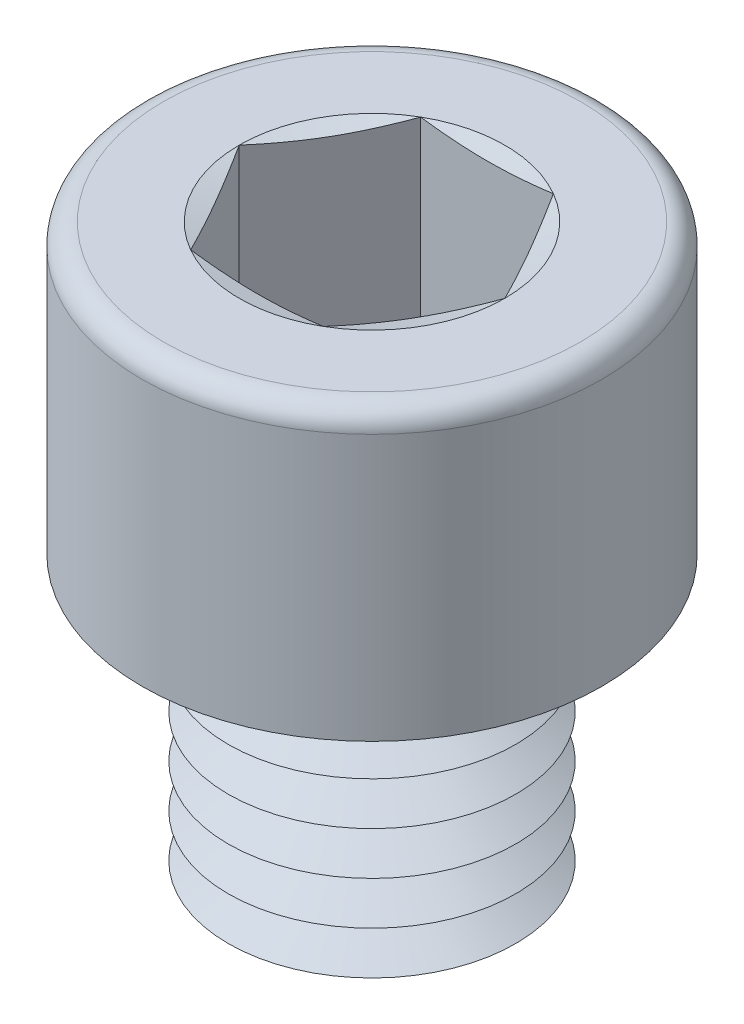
ISO-10303-21;
HEADER;
FILE_DESCRIPTION(('STEP AP214'),'2;1');
FILE_NAME('part.step','',(''),(''),'','','');
FILE_SCHEMA(('AUTOMOTIVE_DESIGN { 1 0 10303 214 1 1 1 1 }'));
ENDSEC;
DATA;
#1=APPLICATION_CONTEXT('core data for automotive mechanical design processes');
#2=APPLICATION_PROTOCOL_DEFINITION('international standard','automotive_design',2000,#1);
#3=PRODUCT_CONTEXT('',#1,'mechanical');
#4=PRODUCT('Part','Part','',(#3));
#5=PRODUCT_RELATED_PRODUCT_CATEGORY('part','',(#4));
#6=PRODUCT_DEFINITION_FORMATION('','',#4);
#7=PRODUCT_DEFINITION_CONTEXT('part definition',#1,'design');
#8=PRODUCT_DEFINITION('design','',#6,#7);
#9=PRODUCT_DEFINITION_SHAPE('','',#8);
#10=(LENGTH_UNIT() NAMED_UNIT(*) SI_UNIT(.MILLI.,.METRE.));
#11=(NAMED_UNIT(*) PLANE_ANGLE_UNIT() SI_UNIT($,.RADIAN.));
#12=(NAMED_UNIT(*) SI_UNIT($,.STERADIAN.) SOLID_ANGLE_UNIT());
#13=UNCERTAINTY_MEASURE_WITH_UNIT(LENGTH_MEASURE(1.E-05),#10,'distance_accuracy_value','');
#14=(GEOMETRIC_REPRESENTATION_CONTEXT(3) GLOBAL_UNCERTAINTY_ASSIGNED_CONTEXT((#13)) GLOBAL_UNIT_ASSIGNED_CONTEXT((#10,
#11,#12)) REPRESENTATION_CONTEXT('',''));
#15=CARTESIAN_POINT('',(0.,0.,0.));
#16=DIRECTION('',(0.,0.,1.));
#17=DIRECTION('',(1.,0.,0.));
#18=AXIS2_PLACEMENT_3D('',#15,#16,#17);
#19=CARTESIAN_POINT('',(0.,6.,0.));
#20=DIRECTION('',(0.,1.,0.));
#21=DIRECTION('',(0.,0.,1.));
#22=AXIS2_PLACEMENT_3D('',#19,#20,#21);
#23=CONICAL_SURFACE('',#22,3.70096189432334,1.0471975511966);
#24=CARTESIAN_POINT('',(0.,6.75,0.));
#25=DIRECTION('',(0.,1.,0.));
#26=DIRECTION('',(0.,0.,1.));
#27=AXIS2_PLACEMENT_3D('',#24,#25,#26);
#28=CIRCLE('',#27,5.);
#29=CARTESIAN_POINT('',(0.,6.75,5.));
#30=VERTEX_POINT('',#29);
#31=EDGE_CURVE('E368',#30,#30,#28,.T.);
#32=ORIENTED_EDGE('',*,*,#31,.F.);
#33=EDGE_LOOP('',(#32));
#34=FACE_BOUND('',#33,.T.);
#35=CARTESIAN_POINT('',(0.,6.,0.));
#36=DIRECTION('',(0.,1.,0.));
#37=DIRECTION('',(0.,0.,1.));
#38=AXIS2_PLACEMENT_3D('',#35,#36,#37);
#39=CIRCLE('',#38,3.70096189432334);
#40=CARTESIAN_POINT('',(0.,6.,3.70096189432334));
#41=VERTEX_POINT('',#40);
#42=EDGE_CURVE('E372',#41,#41,#39,.T.);
#43=ORIENTED_EDGE('',*,*,#42,.T.);
#44=EDGE_LOOP('',(#43));
#45=FACE_BOUND('',#44,.T.);
#46=ADVANCED_FACE('F41',(#34,#45),#23,.T.);
#47=CARTESIAN_POINT('',(0.,5.25,0.));
#48=DIRECTION('',(0.,-1.,0.));
#49=DIRECTION('',(0.,0.,-1.));
#50=AXIS2_PLACEMENT_3D('',#47,#48,#49);
#51=CONICAL_SURFACE('',#50,5.,1.0471975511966);
#52=ORIENTED_EDGE('',*,*,#42,.F.);
#53=EDGE_LOOP('',(#52));
#54=FACE_BOUND('',#53,.T.);
#55=CARTESIAN_POINT('',(0.,5.25,0.));
#56=DIRECTION('',(0.,1.,0.));
#57=DIRECTION('',(0.,0.,1.));
#58=AXIS2_PLACEMENT_3D('',#55,#56,#57);
#59=CIRCLE('',#58,5.);
#60=CARTESIAN_POINT('',(0.,5.25,5.));
#61=VERTEX_POINT('',#60);
#62=EDGE_CURVE('E375',#61,#61,#59,.T.);
#63=ORIENTED_EDGE('',*,*,#62,.T.);
#64=EDGE_LOOP('',(#63));
#65=FACE_BOUND('',#64,.T.);
#66=ADVANCED_FACE('F250',(#54,#65),#51,.T.);
#67=CARTESIAN_POINT('',(0.,0.,0.));
#68=DIRECTION('',(0.,1.,0.));
#69=DIRECTION('',(0.,0.,1.));
#70=AXIS2_PLACEMENT_3D('',#67,#68,#69);
#71=PLANE('',#70);
#72=CARTESIAN_POINT('',(0.,0.,0.));
#73=DIRECTION('',(0.,1.,0.));
#74=DIRECTION('',(0.,0.,1.));
#75=AXIS2_PLACEMENT_3D('',#72,#73,#74);
#76=CIRCLE('',#75,3.70096189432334);
#77=CARTESIAN_POINT('',(0.,0.,3.70096189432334));
#78=VERTEX_POINT('',#77);
#79=EDGE_CURVE('E402',#78,#78,#76,.T.);
#80=ORIENTED_EDGE('',*,*,#79,.F.);
#81=EDGE_LOOP('',(#80));
#82=FACE_BOUND('',#81,.T.);
#83=ADVANCED_FACE('F247',(#82),#71,.F.);
#84=CARTESIAN_POINT('',(0.,0.,0.));
#85=DIRECTION('',(0.,1.,0.));
#86=DIRECTION('',(0.,0.,1.));
#87=AXIS2_PLACEMENT_3D('',#84,#85,#86);
#88=CONICAL_SURFACE('',#87,3.70096189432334,1.0471975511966);
#89=CARTESIAN_POINT('',(0.,0.749999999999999,0.));
#90=DIRECTION('',(0.,1.,0.));
#91=DIRECTION('',(0.,0.,1.));
#92=AXIS2_PLACEMENT_3D('',#89,#90,#91);
#93=CIRCLE('',#92,5.);
#94=CARTESIAN_POINT('',(0.,0.749999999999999,5.));
#95=VERTEX_POINT('',#94);
#96=EDGE_CURVE('E399',#95,#95,#93,.T.);
#97=ORIENTED_EDGE('',*,*,#96,.F.);
#98=EDGE_LOOP('',(#97));
#99=FACE_BOUND('',#98,.T.);
#100=ORIENTED_EDGE('',*,*,#79,.T.);
#101=EDGE_LOOP('',(#100));
#102=FACE_BOUND('',#101,.T.);
#103=ADVANCED_FACE('F249',(#99,#102),#88,.T.);
#104=CARTESIAN_POINT('',(0.,0.749999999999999,0.));
#105=DIRECTION('',(0.,-1.,0.));
#106=DIRECTION('',(0.,0.,-1.));
#107=AXIS2_PLACEMENT_3D('',#104,#105,#106);
#108=CONICAL_SURFACE('',#107,5.,1.0471975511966);
#109=CARTESIAN_POINT('',(0.,1.5,0.));
#110=DIRECTION('',(0.,1.,0.));
#111=DIRECTION('',(0.,0.,1.));
#112=AXIS2_PLACEMENT_3D('',#109,#110,#111);
#113=CIRCLE('',#112,3.70096189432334);
#114=CARTESIAN_POINT('',(0.,1.5,3.70096189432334));
#115=VERTEX_POINT('',#114);
#116=EDGE_CURVE('E395',#115,#115,#113,.T.);
#117=ORIENTED_EDGE('',*,*,#116,.F.);
#118=EDGE_LOOP('',(#117));
#119=FACE_BOUND('',#118,.T.);
#120=ORIENTED_EDGE('',*,*,#96,.T.);
#121=EDGE_LOOP('',(#120));
#122=FACE_BOUND('',#121,.T.);
#123=ADVANCED_FACE('F290',(#119,#122),#108,.T.);
#124=CARTESIAN_POINT('',(0.,1.5,0.));
#125=DIRECTION('',(0.,1.,0.));
#126=DIRECTION('',(0.,0.,1.));
#127=AXIS2_PLACEMENT_3D('',#124,#125,#126);
#128=CONICAL_SURFACE('',#127,3.70096189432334,1.0471975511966);
#129=CARTESIAN_POINT('',(0.,2.25,0.));
#130=DIRECTION('',(0.,1.,0.));
#131=DIRECTION('',(0.,0.,1.));
#132=AXIS2_PLACEMENT_3D('',#129,#130,#131);
#133=CIRCLE('',#132,5.);
#134=CARTESIAN_POINT('',(0.,2.25,5.));
#135=VERTEX_POINT('',#134);
#136=EDGE_CURVE('E391',#135,#135,#133,.T.);
#137=ORIENTED_EDGE('',*,*,#136,.F.);
#138=EDGE_LOOP('',(#137));
#139=FACE_BOUND('',#138,.T.);
#140=ORIENTED_EDGE('',*,*,#116,.T.);
#141=EDGE_LOOP('',(#140));
#142=FACE_BOUND('',#141,.T.);
#143=ADVANCED_FACE('F285',(#139,#142),#128,.T.);
#144=CARTESIAN_POINT('',(0.,2.25,0.));
#145=DIRECTION('',(0.,-1.,0.));
#146=DIRECTION('',(0.,0.,-1.));
#147=AXIS2_PLACEMENT_3D('',#144,#145,#146);
#148=CONICAL_SURFACE('',#147,5.,1.0471975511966);
#149=CARTESIAN_POINT('',(0.,3.,0.));
#150=DIRECTION('',(0.,1.,0.));
#151=DIRECTION('',(0.,0.,1.));
#152=AXIS2_PLACEMENT_3D('',#149,#150,#151);
#153=CIRCLE('',#152,3.70096189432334);
#154=CARTESIAN_POINT('',(0.,3.,3.70096189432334));
#155=VERTEX_POINT('',#154);
#156=EDGE_CURVE('E387',#155,#155,#153,.T.);
#157=ORIENTED_EDGE('',*,*,#156,.F.);
#158=EDGE_LOOP('',(#157));
#159=FACE_BOUND('',#158,.T.);
#160=ORIENTED_EDGE('',*,*,#136,.T.);
#161=EDGE_LOOP('',(#160));
#162=FACE_BOUND('',#161,.T.);
#163=ADVANCED_FACE('F282',(#159,#162),#148,.T.);
#164=CARTESIAN_POINT('',(0.,3.,0.));
#165=DIRECTION('',(0.,1.,0.));
#166=DIRECTION('',(0.,0.,1.));
#167=AXIS2_PLACEMENT_3D('',#164,#165,#166);
#168=CONICAL_SURFACE('',#167,3.70096189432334,1.0471975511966);
#169=CARTESIAN_POINT('',(0.,3.75,0.));
#170=DIRECTION('',(0.,1.,0.));
#171=DIRECTION('',(0.,0.,1.));
#172=AXIS2_PLACEMENT_3D('',#169,#170,#171);
#173=CIRCLE('',#172,5.);
#174=CARTESIAN_POINT('',(0.,3.75,5.));
#175=VERTEX_POINT('',#174);
#176=EDGE_CURVE('E383',#175,#175,#173,.T.);
#177=ORIENTED_EDGE('',*,*,#176,.F.);
#178=EDGE_LOOP('',(#177));
#179=FACE_BOUND('',#178,.T.);
#180=ORIENTED_EDGE('',*,*,#156,.T.);
#181=EDGE_LOOP('',(#180));
#182=FACE_BOUND('',#181,.T.);
#183=ADVANCED_FACE('F276',(#179,#182),#168,.T.);
#184=CARTESIAN_POINT('',(0.,3.75,0.));
#185=DIRECTION('',(0.,-1.,0.));
#186=DIRECTION('',(0.,0.,-1.));
#187=AXIS2_PLACEMENT_3D('',#184,#185,#186);
#188=CONICAL_SURFACE('',#187,5.,1.0471975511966);
#189=CARTESIAN_POINT('',(0.,4.5,0.));
#190=DIRECTION('',(0.,1.,0.));
#191=DIRECTION('',(0.,0.,1.));
#192=AXIS2_PLACEMENT_3D('',#189,#190,#191);
#193=CIRCLE('',#192,3.70096189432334);
#194=CARTESIAN_POINT('',(0.,4.5,3.70096189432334));
#195=VERTEX_POINT('',#194);
#196=EDGE_CURVE('E379',#195,#195,#193,.T.);
#197=ORIENTED_EDGE('',*,*,#196,.F.);
#198=EDGE_LOOP('',(#197));
#199=FACE_BOUND('',#198,.T.);
#200=ORIENTED_EDGE('',*,*,#176,.T.);
#201=EDGE_LOOP('',(#200));
#202=FACE_BOUND('',#201,.T.);
#203=ADVANCED_FACE('F272',(#199,#202),#188,.T.);
#204=CARTESIAN_POINT('',(0.,4.5,0.));
#205=DIRECTION('',(0.,1.,0.));
#206=DIRECTION('',(0.,0.,1.));
#207=AXIS2_PLACEMENT_3D('',#204,#205,#206);
#208=CONICAL_SURFACE('',#207,3.70096189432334,1.0471975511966);
#209=ORIENTED_EDGE('',*,*,#62,.F.);
#210=EDGE_LOOP('',(#209));
#211=FACE_BOUND('',#210,.T.);
#212=ORIENTED_EDGE('',*,*,#196,.T.);
#213=EDGE_LOOP('',(#212));
#214=FACE_BOUND('',#213,.T.);
#215=ADVANCED_FACE('F275',(#211,#214),#208,.T.);
#216=CARTESIAN_POINT('',(0.,7.5,0.));
#217=DIRECTION('',(0.,1.,0.));
#218=DIRECTION('',(0.,0.,1.));
#219=AXIS2_PLACEMENT_3D('',#216,#217,#218);
#220=CONICAL_SURFACE('',#219,3.70096189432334,1.0471975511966);
#221=CARTESIAN_POINT('',(0.,8.25,0.));
#222=DIRECTION('',(0.,1.,0.));
#223=DIRECTION('',(0.,0.,1.));
#224=AXIS2_PLACEMENT_3D('',#221,#222,#223);
#225=CIRCLE('',#224,5.);
#226=CARTESIAN_POINT('',(0.,8.25,5.));
#227=VERTEX_POINT('',#226);
#228=EDGE_CURVE('E352',#227,#227,#225,.T.);
#229=ORIENTED_EDGE('',*,*,#228,.F.);
#230=EDGE_LOOP('',(#229));
#231=FACE_BOUND('',#230,.T.);
#232=CARTESIAN_POINT('',(0.,7.5,0.));
#233=DIRECTION('',(0.,1.,0.));
#234=DIRECTION('',(0.,0.,1.));
#235=AXIS2_PLACEMENT_3D('',#232,#233,#234);
#236=CIRCLE('',#235,3.70096189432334);
#237=CARTESIAN_POINT('',(0.,7.5,3.70096189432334));
#238=VERTEX_POINT('',#237);
#239=EDGE_CURVE('E364',#238,#238,#236,.T.);
#240=ORIENTED_EDGE('',*,*,#239,.T.);
#241=EDGE_LOOP('',(#240));
#242=FACE_BOUND('',#241,.T.);
#243=ADVANCED_FACE('F280',(#231,#242),#220,.T.);
#244=CARTESIAN_POINT('',(0.,6.75,0.));
#245=DIRECTION('',(0.,-1.,0.));
#246=DIRECTION('',(0.,0.,-1.));
#247=AXIS2_PLACEMENT_3D('',#244,#245,#246);
#248=CONICAL_SURFACE('',#247,5.,1.0471975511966);
#249=ORIENTED_EDGE('',*,*,#239,.F.);
#250=EDGE_LOOP('',(#249));
#251=FACE_BOUND('',#250,.T.);
#252=ORIENTED_EDGE('',*,*,#31,.T.);
#253=EDGE_LOOP('',(#252));
#254=FACE_BOUND('',#253,.T.);
#255=ADVANCED_FACE('F641',(#251,#254),#248,.T.);
#256=CARTESIAN_POINT('',(0.,9.,0.));
#257=DIRECTION('',(0.,1.,0.));
#258=DIRECTION('',(0.,0.,1.));
#259=AXIS2_PLACEMENT_3D('',#256,#257,#258);
#260=CONICAL_SURFACE('',#259,3.70096189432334,1.0471975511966);
#261=CARTESIAN_POINT('',(0.,9.75,0.));
#262=DIRECTION('',(0.,1.,0.));
#263=DIRECTION('',(0.,0.,1.));
#264=AXIS2_PLACEMENT_3D('',#261,#262,#263);
#265=CIRCLE('',#264,5.);
#266=CARTESIAN_POINT('',(0.,9.75,5.));
#267=VERTEX_POINT('',#266);
#268=EDGE_CURVE('E359',#267,#267,#265,.T.);
#269=ORIENTED_EDGE('',*,*,#268,.F.);
#270=EDGE_LOOP('',(#269));
#271=FACE_BOUND('',#270,.T.);
#272=CARTESIAN_POINT('',(0.,9.,0.));
#273=DIRECTION('',(0.,1.,0.));
#274=DIRECTION('',(0.,0.,1.));
#275=AXIS2_PLACEMENT_3D('',#272,#273,#274);
#276=CIRCLE('',#275,3.70096189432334);
#277=CARTESIAN_POINT('',(0.,9.,3.70096189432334));
#278=VERTEX_POINT('',#277);
#279=EDGE_CURVE('E347',#278,#278,#276,.T.);
#280=ORIENTED_EDGE('',*,*,#279,.T.);
#281=EDGE_LOOP('',(#280));
#282=FACE_BOUND('',#281,.T.);
#283=ADVANCED_FACE('F650',(#271,#282),#260,.T.);
#284=CARTESIAN_POINT('',(0.,8.25,0.));
#285=DIRECTION('',(0.,-1.,0.));
#286=DIRECTION('',(0.,0.,-1.));
#287=AXIS2_PLACEMENT_3D('',#284,#285,#286);
#288=CONICAL_SURFACE('',#287,5.,1.0471975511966);
#289=ORIENTED_EDGE('',*,*,#279,.F.);
#290=EDGE_LOOP('',(#289));
#291=FACE_BOUND('',#290,.T.);
#292=ORIENTED_EDGE('',*,*,#228,.T.);
#293=EDGE_LOOP('',(#292));
#294=FACE_BOUND('',#293,.T.);
#295=ADVANCED_FACE('F194',(#291,#294),#288,.T.);
#296=CARTESIAN_POINT('',(0.,20.,0.));
#297=DIRECTION('',(0.,1.,0.));
#298=DIRECTION('',(0.,0.,1.));
#299=AXIS2_PLACEMENT_3D('',#296,#297,#298);
#300=PLANE('',#299);
#301=CARTESIAN_POINT('',(0.,20.,0.));
#302=DIRECTION('',(0.,1.,0.));
#303=DIRECTION('',(0.,0.,1.));
#304=AXIS2_PLACEMENT_3D('',#301,#302,#303);
#305=CIRCLE('',#304,4.61880215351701);
#306=CARTESIAN_POINT('',(2.3094010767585,20.,4.));
#307=VERTEX_POINT('',#306);
#308=CARTESIAN_POINT('',(4.61880215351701,20.,0.));
#309=VERTEX_POINT('',#308);
#310=EDGE_CURVE('E121',#307,#309,#305,.T.);
#311=ORIENTED_EDGE('',*,*,#310,.F.);
#312=CARTESIAN_POINT('',(0.,20.,0.));
#313=DIRECTION('',(0.,1.,0.));
#314=DIRECTION('',(0.,0.,1.));
#315=AXIS2_PLACEMENT_3D('',#312,#313,#314);
#316=CIRCLE('',#315,4.61880215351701);
#317=CARTESIAN_POINT('',(-2.3094010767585,20.,4.));
#318=VERTEX_POINT('',#317);
#319=EDGE_CURVE('E45',#318,#307,#316,.T.);
#320=ORIENTED_EDGE('',*,*,#319,.F.);
#321=CARTESIAN_POINT('',(-4.61880215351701,20.,0.));
#322=VERTEX_POINT('',#321);
#323=EDGE_CURVE('E138',#322,#318,#316,.T.);
#324=ORIENTED_EDGE('',*,*,#323,.F.);
#325=CARTESIAN_POINT('',(-2.3094010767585,20.,-4.));
#326=VERTEX_POINT('',#325);
#327=EDGE_CURVE('E476',#326,#322,#316,.T.);
#328=ORIENTED_EDGE('',*,*,#327,.F.);
#329=CARTESIAN_POINT('',(2.3094010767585,20.,-4.));
#330=VERTEX_POINT('',#329);
#331=EDGE_CURVE('E51',#330,#326,#316,.T.);
#332=ORIENTED_EDGE('',*,*,#331,.F.);
#333=EDGE_CURVE('E11',#309,#330,#316,.T.);
#334=ORIENTED_EDGE('',*,*,#333,.F.);
#335=EDGE_LOOP('',(#311,#320,#324,#328,#332,#334));
#336=FACE_BOUND('',#335,.T.);
#337=CARTESIAN_POINT('',(0.,20.,0.));
#338=DIRECTION('',(0.,1.,0.));
#339=DIRECTION('',(0.,0.,1.));
#340=AXIS2_PLACEMENT_3D('',#337,#338,#339);
#341=CIRCLE('',#340,7.25);
#342=CARTESIAN_POINT('',(0.,20.,7.25));
#343=VERTEX_POINT('',#342);
#344=EDGE_CURVE('E446',#343,#343,#341,.T.);
#345=ORIENTED_EDGE('',*,*,#344,.T.);
#346=EDGE_LOOP('',(#345));
#347=FACE_BOUND('',#346,.T.);
#348=ADVANCED_FACE('F140',(#336,#347),#300,.T.);
#349=CARTESIAN_POINT('',(0.,19.25,0.));
#350=DIRECTION('',(0.,1.,0.));
#351=DIRECTION('',(0.,0.,1.));
#352=AXIS2_PLACEMENT_3D('',#349,#350,#351);
#353=TOROIDAL_SURFACE('',#352,7.25,0.75);
#354=CARTESIAN_POINT('',(0.,19.25,0.));
#355=DIRECTION('',(0.,1.,0.));
#356=DIRECTION('',(0.,0.,1.));
#357=AXIS2_PLACEMENT_3D('',#354,#355,#356);
#358=CIRCLE('',#357,8.);
#359=CARTESIAN_POINT('',(0.,19.25,8.));
#360=VERTEX_POINT('',#359);
#361=EDGE_CURVE('E449',#360,#360,#358,.F.);
#362=ORIENTED_EDGE('',*,*,#361,.F.);
#363=EDGE_LOOP('',(#362));
#364=FACE_BOUND('',#363,.T.);
#365=ORIENTED_EDGE('',*,*,#344,.F.);
#366=EDGE_LOOP('',(#365));
#367=FACE_BOUND('',#366,.T.);
#368=ADVANCED_FACE('F43',(#364,#367),#353,.T.);
#369=CARTESIAN_POINT('',(0.,20.,0.));
#370=DIRECTION('',(0.,-1.,0.));
#371=DIRECTION('',(0.,0.,-1.));
#372=AXIS2_PLACEMENT_3D('',#369,#370,#371);
#373=CYLINDRICAL_SURFACE('',#372,8.);
#374=ORIENTED_EDGE('',*,*,#361,.T.);
#375=EDGE_LOOP('',(#374));
#376=FACE_BOUND('',#375,.T.);
#377=CARTESIAN_POINT('',(0.,10.,0.));
#378=DIRECTION('',(0.,1.,0.));
#379=DIRECTION('',(0.,0.,1.));
#380=AXIS2_PLACEMENT_3D('',#377,#378,#379);
#381=CIRCLE('',#380,8.);
#382=CARTESIAN_POINT('',(0.,10.,8.));
#383=VERTEX_POINT('',#382);
#384=EDGE_CURVE('E433',#383,#383,#381,.T.);
#385=ORIENTED_EDGE('',*,*,#384,.T.);
#386=EDGE_LOOP('',(#385));
#387=FACE_BOUND('',#386,.T.);
#388=ADVANCED_FACE('F242',(#376,#387),#373,.T.);
#389=CARTESIAN_POINT('',(0.,10.,0.));
#390=DIRECTION('',(0.,1.,0.));
#391=DIRECTION('',(0.,0.,1.));
#392=AXIS2_PLACEMENT_3D('',#389,#390,#391);
#393=PLANE('',#392);
#394=ORIENTED_EDGE('',*,*,#384,.F.);
#395=EDGE_LOOP('',(#394));
#396=FACE_BOUND('',#395,.T.);
#397=CARTESIAN_POINT('',(0.,10.,0.));
#398=DIRECTION('',(0.,1.,0.));
#399=DIRECTION('',(0.,0.,1.));
#400=AXIS2_PLACEMENT_3D('',#397,#398,#399);
#401=CIRCLE('',#400,5.);
#402=CARTESIAN_POINT('',(0.,10.,5.));
#403=VERTEX_POINT('',#402);
#404=EDGE_CURVE('E442',#403,#403,#401,.T.);
#405=ORIENTED_EDGE('',*,*,#404,.T.);
#406=EDGE_LOOP('',(#405));
#407=FACE_BOUND('',#406,.T.);
#408=ADVANCED_FACE('F238',(#396,#407),#393,.F.);
#409=CARTESIAN_POINT('',(0.,10.,0.));
#410=DIRECTION('',(0.,-1.,0.));
#411=DIRECTION('',(0.,0.,-1.));
#412=AXIS2_PLACEMENT_3D('',#409,#410,#411);
#413=CYLINDRICAL_SURFACE('',#412,5.);
#414=ORIENTED_EDGE('',*,*,#268,.T.);
#415=EDGE_LOOP('',(#414));
#416=FACE_BOUND('',#415,.T.);
#417=ORIENTED_EDGE('',*,*,#404,.F.);
#418=EDGE_LOOP('',(#417));
#419=FACE_BOUND('',#418,.T.);
#420=ADVANCED_FACE('F241',(#416,#419),#413,.T.);
#421=CARTESIAN_POINT('',(0.,20.,0.));
#422=DIRECTION('',(0.,1.,0.));
#423=DIRECTION('',(0.,0.,1.));
#424=AXIS2_PLACEMENT_3D('',#421,#422,#423);
#425=CONICAL_SURFACE('',#424,4.61880215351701,1.30899693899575);
#426=ORIENTED_EDGE('',*,*,#319,.T.);
#427=CARTESIAN_POINT('',(-6.02881516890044,20.7010337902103,4.));
#428=CARTESIAN_POINT('',(-5.8481958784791,20.6607170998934,4.));
#429=CARTESIAN_POINT('',(-5.66746141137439,20.6209072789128,4.));
#430=CARTESIAN_POINT('',(-5.30570552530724,20.5425748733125,4.));
#431=CARTESIAN_POINT('',(-5.12468409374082,20.5040523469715,4.));
#432=CARTESIAN_POINT('',(-4.76212658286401,20.4285326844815,4.));
#433=CARTESIAN_POINT('',(-4.58059016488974,20.3915371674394,4.));
#434=CARTESIAN_POINT('',(-4.21713405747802,20.3194839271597,4.));
#435=CARTESIAN_POINT('',(-4.03521437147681,20.2844261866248,4.));
#436=CARTESIAN_POINT('',(-3.67250657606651,20.217001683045,4.));
#437=CARTESIAN_POINT('',(-3.49172236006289,20.1846141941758,4.));
#438=CARTESIAN_POINT('',(-3.12965653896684,20.1227577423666,4.));
#439=CARTESIAN_POINT('',(-2.94837492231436,20.093288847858,4.));
#440=CARTESIAN_POINT('',(-2.40374454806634,20.0102645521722,4.));
#441=CARTESIAN_POINT('',(-2.03952090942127,19.9620742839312,4.));
#442=CARTESIAN_POINT('',(-1.48950033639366,19.905182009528,4.));
#443=CARTESIAN_POINT('',(-1.30450135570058,19.8887355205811,4.));
#444=CARTESIAN_POINT('',(-0.934053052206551,19.861988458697,4.));
#445=CARTESIAN_POINT('',(-0.74860373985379,19.8516877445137,4.));
#446=CARTESIAN_POINT('',(-0.377528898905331,19.8378309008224,4.));
#447=CARTESIAN_POINT('',(-0.191903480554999,19.834271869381,4.));
#448=CARTESIAN_POINT('',(0.179350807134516,19.8341156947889,4.));
#449=CARTESIAN_POINT('',(0.364979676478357,19.8375185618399,4.));
#450=CARTESIAN_POINT('',(0.736742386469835,19.8510980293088,4.));
#451=CARTESIAN_POINT('',(0.922875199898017,19.8613021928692,4.));
#452=CARTESIAN_POINT('',(1.29469888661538,19.8879135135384,4.));
#453=CARTESIAN_POINT('',(1.48038973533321,19.9043210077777,4.));
#454=CARTESIAN_POINT('',(1.85132520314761,19.942529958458,4.));
#455=CARTESIAN_POINT('',(2.036569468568,19.9643347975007,4.));
#456=CARTESIAN_POINT('',(2.40646407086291,20.0124559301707,4.));
#457=CARTESIAN_POINT('',(2.59111440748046,20.0387722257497,4.));
#458=CARTESIAN_POINT('',(2.96467049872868,20.0958323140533,4.));
#459=CARTESIAN_POINT('',(3.15356118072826,20.1266739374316,4.));
#460=CARTESIAN_POINT('',(3.53080577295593,20.1914895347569,4.));
#461=CARTESIAN_POINT('',(3.71915966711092,20.225463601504,4.));
#462=CARTESIAN_POINT('',(4.2835627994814,20.331122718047,4.));
#463=CARTESIAN_POINT('',(4.65891157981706,20.4065379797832,4.));
#464=CARTESIAN_POINT('',(5.40835351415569,20.5637698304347,4.));
#465=CARTESIAN_POINT('',(5.78244627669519,20.6455882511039,4.));
#466=CARTESIAN_POINT('',(6.52968076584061,20.8134827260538,4.));
#467=CARTESIAN_POINT('',(6.90282246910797,20.8995588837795,4.));
#468=CARTESIAN_POINT('',(7.64386653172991,21.0735615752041,4.));
#469=CARTESIAN_POINT('',(8.01177724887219,21.1614526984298,4.));
#470=CARTESIAN_POINT('',(8.74711499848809,21.3392675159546,4.));
#471=CARTESIAN_POINT('',(9.11454201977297,21.4291912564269,4.));
#472=CARTESIAN_POINT('',(9.84851788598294,21.6103931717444,4.));
#473=CARTESIAN_POINT('',(10.2150672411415,21.7016692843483,4.));
#474=CARTESIAN_POINT('',(10.9478692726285,21.8853497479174,4.));
#475=CARTESIAN_POINT('',(11.3141219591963,21.977754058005,4.));
#476=CARTESIAN_POINT('',(11.6802738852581,22.0705515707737,4.));
#477=B_SPLINE_CURVE_WITH_KNOTS('',3,(#427,#428,#429,#430,#431,#432,#433,#434,#435,#436,#437,
#438,#439,#440,#441,#442,#443,#444,#445,#446,#447,#448,#449,#450,#451,#452,#453,#454,#455,#456,
#457,#458,#459,#460,#461,#462,#463,#464,#465,#466,#467,#468,#469,#470,#471,#472,#473,#474,#475,
#476),.UNSPECIFIED.,.F.,.F.,(4,2,2,2,2,2,2,2,2,2,2,2,2,2,2,2,2,2,2,2,2,2,2,2,4),(0.,
0.555194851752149,1.11041480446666,1.6662090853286,2.22199840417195,2.77296094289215,
3.32393639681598,4.42561440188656,4.98271716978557,5.5398071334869,6.09665724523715,
6.65350817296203,7.21262964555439,7.77178150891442,8.33128469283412,8.89078811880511,
9.46493123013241,10.0390913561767,11.1875388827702,12.3363161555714,13.4851213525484,
14.6199040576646,15.7547125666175,16.8879395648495,18.0211256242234),.UNSPECIFIED.);
#478=EDGE_CURVE('E127',#318,#307,#477,.T.);
#479=ORIENTED_EDGE('',*,*,#478,.F.);
#480=EDGE_LOOP('',(#426,#479));
#481=FACE_BOUND('',#480,.T.);
#482=ADVANCED_FACE('F132',(#481),#425,.F.);
#483=ORIENTED_EDGE('',*,*,#323,.T.);
#484=CARTESIAN_POINT('',(-4.61891762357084,20.0000309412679,-0.000200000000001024));
#485=CARTESIAN_POINT('',(-4.52300443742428,19.9743194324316,0.165926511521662));
#486=CARTESIAN_POINT('',(-4.42691734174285,19.9509775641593,0.332354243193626));
#487=CARTESIAN_POINT('',(-4.23440378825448,19.9099680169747,0.665797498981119));
#488=CARTESIAN_POINT('',(-4.13797720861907,19.8923026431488,0.832813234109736));
#489=CARTESIAN_POINT('',(-3.94536936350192,19.8636774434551,1.16641980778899));
#490=CARTESIAN_POINT('',(-3.84918940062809,19.8526834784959,1.33300839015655));
#491=CARTESIAN_POINT('',(-3.65670681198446,19.8379416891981,1.66639801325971));
#492=CARTESIAN_POINT('',(-3.56040421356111,19.8341924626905,1.83319900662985));
#493=CARTESIAN_POINT('',(-3.3677990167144,19.8341924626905,2.16680099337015));
#494=CARTESIAN_POINT('',(-3.27149641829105,19.8379416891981,2.33360198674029));
#495=CARTESIAN_POINT('',(-3.07901382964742,19.8526834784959,2.66699160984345));
#496=CARTESIAN_POINT('',(-2.98283386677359,19.8636774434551,2.83358019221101));
#497=CARTESIAN_POINT('',(-2.79022602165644,19.8923026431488,3.16718676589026));
#498=CARTESIAN_POINT('',(-2.69379944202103,19.9099680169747,3.33420250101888));
#499=CARTESIAN_POINT('',(-2.50128588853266,19.9509775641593,3.66764575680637));
#500=CARTESIAN_POINT('',(-2.40519879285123,19.9743194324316,3.83407348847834));
#501=CARTESIAN_POINT('',(-2.30928560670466,20.0000309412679,4.0002));
#502=B_SPLINE_CURVE_WITH_KNOTS('',3,(#484,#485,#486,#487,#488,#489,#490,#491,#492,#493,#494,
#495,#496,#497,#498,#499,#500,#501),.UNSPECIFIED.,.F.,.F.,(4,2,2,2,2,2,2,2,4),(0.,
0.580655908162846,1.1615473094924,1.73944052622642,2.31722188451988,2.89500324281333,
3.47289645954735,4.05378786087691,4.63444376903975),.UNSPECIFIED.);
#503=EDGE_CURVE('E163',#322,#318,#502,.T.);
#504=ORIENTED_EDGE('',*,*,#503,.F.);
#505=EDGE_LOOP('',(#483,#504));
#506=FACE_BOUND('',#505,.T.);
#507=ADVANCED_FACE('F257',(#506),#425,.F.);
#508=ORIENTED_EDGE('',*,*,#327,.T.);
#509=CARTESIAN_POINT('',(-2.30928560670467,20.0000309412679,-4.0002));
#510=CARTESIAN_POINT('',(-2.40519879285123,19.9743194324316,-3.83407348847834));
#511=CARTESIAN_POINT('',(-2.50128588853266,19.9509775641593,-3.66764575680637));
#512=CARTESIAN_POINT('',(-2.69379944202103,19.9099680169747,-3.33420250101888));
#513=CARTESIAN_POINT('',(-2.79022602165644,19.8923026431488,-3.16718676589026));
#514=CARTESIAN_POINT('',(-2.98283386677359,19.8636774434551,-2.83358019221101));
#515=CARTESIAN_POINT('',(-3.07901382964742,19.8526834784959,-2.66699160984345));
#516=CARTESIAN_POINT('',(-3.27149641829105,19.8379416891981,-2.33360198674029));
#517=CARTESIAN_POINT('',(-3.3677990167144,19.8341924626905,-2.16680099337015));
#518=CARTESIAN_POINT('',(-3.56040421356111,19.8341924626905,-1.83319900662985));
#519=CARTESIAN_POINT('',(-3.65670681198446,19.8379416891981,-1.66639801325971));
#520=CARTESIAN_POINT('',(-3.84918940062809,19.8526834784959,-1.33300839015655));
#521=CARTESIAN_POINT('',(-3.94536936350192,19.8636774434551,-1.16641980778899));
#522=CARTESIAN_POINT('',(-4.13797720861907,19.8923026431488,-0.832813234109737));
#523=CARTESIAN_POINT('',(-4.23440378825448,19.9099680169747,-0.665797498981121));
#524=CARTESIAN_POINT('',(-4.42691734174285,19.9509775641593,-0.332354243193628));
#525=CARTESIAN_POINT('',(-4.52300443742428,19.9743194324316,-0.165926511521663));
#526=CARTESIAN_POINT('',(-4.61891762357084,20.0000309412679,0.000199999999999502));
#527=B_SPLINE_CURVE_WITH_KNOTS('',3,(#509,#510,#511,#512,#513,#514,#515,#516,#517,#518,#519,
#520,#521,#522,#523,#524,#525,#526),.UNSPECIFIED.,.F.,.F.,(4,2,2,2,2,2,2,2,4),(0.,
0.580655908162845,1.1615473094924,1.73944052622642,2.31722188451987,2.89500324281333,
3.47289645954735,4.0537878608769,4.63444376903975),.UNSPECIFIED.);
#528=EDGE_CURVE('E63',#326,#322,#527,.T.);
#529=ORIENTED_EDGE('',*,*,#528,.F.);
#530=EDGE_LOOP('',(#508,#529));
#531=FACE_BOUND('',#530,.T.);
#532=ADVANCED_FACE('F192',(#531),#425,.F.);
#533=ORIENTED_EDGE('',*,*,#331,.T.);
#534=CARTESIAN_POINT('',(-6.02881516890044,20.7010337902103,-4.));
#535=CARTESIAN_POINT('',(-5.8481958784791,20.6607170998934,-4.));
#536=CARTESIAN_POINT('',(-5.66746141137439,20.6209072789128,-4.));
#537=CARTESIAN_POINT('',(-5.30570552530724,20.5425748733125,-4.));
#538=CARTESIAN_POINT('',(-5.12468409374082,20.5040523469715,-4.));
#539=CARTESIAN_POINT('',(-4.76212658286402,20.4285326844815,-4.));
#540=CARTESIAN_POINT('',(-4.58059016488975,20.3915371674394,-4.));
#541=CARTESIAN_POINT('',(-4.21713405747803,20.3194839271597,-4.));
#542=CARTESIAN_POINT('',(-4.03521437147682,20.2844261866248,-4.));
#543=CARTESIAN_POINT('',(-3.67250657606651,20.217001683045,-4.));
#544=CARTESIAN_POINT('',(-3.49172236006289,20.1846141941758,-4.));
#545=CARTESIAN_POINT('',(-3.12965653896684,20.1227577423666,-4.));
#546=CARTESIAN_POINT('',(-2.94837492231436,20.093288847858,-4.));
#547=CARTESIAN_POINT('',(-2.40374454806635,20.0102645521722,-4.));
#548=CARTESIAN_POINT('',(-2.03952090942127,19.9620742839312,-4.));
#549=CARTESIAN_POINT('',(-1.48950033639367,19.905182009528,-4.));
#550=CARTESIAN_POINT('',(-1.30450135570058,19.8887355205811,-4.));
#551=CARTESIAN_POINT('',(-0.934053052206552,19.861988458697,-4.));
#552=CARTESIAN_POINT('',(-0.748603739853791,19.8516877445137,-4.));
#553=CARTESIAN_POINT('',(-0.377528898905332,19.8378309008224,-4.));
#554=CARTESIAN_POINT('',(-0.191903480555,19.834271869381,-4.));
#555=CARTESIAN_POINT('',(0.179350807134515,19.8341156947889,-4.));
#556=CARTESIAN_POINT('',(0.364979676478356,19.8375185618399,-4.));
#557=CARTESIAN_POINT('',(0.736742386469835,19.8510980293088,-4.));
#558=CARTESIAN_POINT('',(0.922875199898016,19.8613021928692,-4.));
#559=CARTESIAN_POINT('',(1.29469888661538,19.8879135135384,-4.));
#560=CARTESIAN_POINT('',(1.48038973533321,19.9043210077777,-4.));
#561=CARTESIAN_POINT('',(1.85132520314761,19.942529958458,-4.));
#562=CARTESIAN_POINT('',(2.036569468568,19.9643347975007,-4.));
#563=CARTESIAN_POINT('',(2.40646407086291,20.0124559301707,-4.));
#564=CARTESIAN_POINT('',(2.59111440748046,20.0387722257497,-4.));
#565=CARTESIAN_POINT('',(2.96467049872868,20.0958323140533,-4.));
#566=CARTESIAN_POINT('',(3.15356118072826,20.1266739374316,-4.));
#567=CARTESIAN_POINT('',(3.53080577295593,20.1914895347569,-4.));
#568=CARTESIAN_POINT('',(3.71915966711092,20.225463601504,-4.));
#569=CARTESIAN_POINT('',(4.2835627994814,20.331122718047,-4.));
#570=CARTESIAN_POINT('',(4.65891157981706,20.4065379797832,-4.));
#571=CARTESIAN_POINT('',(5.40835351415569,20.5637698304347,-4.));
#572=CARTESIAN_POINT('',(5.78244627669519,20.6455882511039,-4.));
#573=CARTESIAN_POINT('',(6.52968076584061,20.8134827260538,-4.));
#574=CARTESIAN_POINT('',(6.90282246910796,20.8995588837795,-4.));
#575=CARTESIAN_POINT('',(7.64386653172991,21.0735615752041,-4.));
#576=CARTESIAN_POINT('',(8.01177724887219,21.1614526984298,-4.));
#577=CARTESIAN_POINT('',(8.74711499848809,21.3392675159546,-4.));
#578=CARTESIAN_POINT('',(9.11454201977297,21.4291912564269,-4.));
#579=CARTESIAN_POINT('',(9.84851788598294,21.6103931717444,-4.));
#580=CARTESIAN_POINT('',(10.2150672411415,21.7016692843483,-4.));
#581=CARTESIAN_POINT('',(10.9478692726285,21.8853497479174,-4.));
#582=CARTESIAN_POINT('',(11.3141219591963,21.977754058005,-4.));
#583=CARTESIAN_POINT('',(11.6802738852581,22.0705515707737,-4.));
#584=B_SPLINE_CURVE_WITH_KNOTS('',3,(#534,#535,#536,#537,#538,#539,#540,#541,#542,#543,#544,
#545,#546,#547,#548,#549,#550,#551,#552,#553,#554,#555,#556,#557,#558,#559,#560,#561,#562,#563,
#564,#565,#566,#567,#568,#569,#570,#571,#572,#573,#574,#575,#576,#577,#578,#579,#580,#581,#582,
#583),.UNSPECIFIED.,.F.,.F.,(4,2,2,2,2,2,2,2,2,2,2,2,2,2,2,2,2,2,2,2,2,2,2,2,4),(0.,
0.555194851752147,1.11041480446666,1.66620908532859,2.22199840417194,2.77296094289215,
3.32393639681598,4.42561440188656,4.98271716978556,5.53980713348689,6.09665724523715,
6.65350817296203,7.21262964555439,7.77178150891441,8.33128469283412,8.89078811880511,
9.46493123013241,10.0390913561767,11.1875388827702,12.3363161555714,13.4851213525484,
14.6199040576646,15.7547125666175,16.8879395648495,18.0211256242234),.UNSPECIFIED.);
#585=EDGE_CURVE('E213',#330,#326,#584,.F.);
#586=ORIENTED_EDGE('',*,*,#585,.F.);
#587=EDGE_LOOP('',(#533,#586));
#588=FACE_BOUND('',#587,.T.);
#589=ADVANCED_FACE('F187',(#588),#425,.F.);
#590=ORIENTED_EDGE('',*,*,#333,.T.);
#591=CARTESIAN_POINT('',(4.61891762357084,20.0000309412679,0.000200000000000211));
#592=CARTESIAN_POINT('',(4.52300443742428,19.9743194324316,-0.165926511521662));
#593=CARTESIAN_POINT('',(4.42691734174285,19.9509775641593,-0.332354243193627));
#594=CARTESIAN_POINT('',(4.23440378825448,19.9099680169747,-0.66579749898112));
#595=CARTESIAN_POINT('',(4.13797720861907,19.8923026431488,-0.832813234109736));
#596=CARTESIAN_POINT('',(3.94536936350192,19.8636774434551,-1.16641980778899));
#597=CARTESIAN_POINT('',(3.84918940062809,19.8526834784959,-1.33300839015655));
#598=CARTESIAN_POINT('',(3.65670681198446,19.8379416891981,-1.66639801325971));
#599=CARTESIAN_POINT('',(3.56040421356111,19.8341924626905,-1.83319900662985));
#600=CARTESIAN_POINT('',(3.3677990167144,19.8341924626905,-2.16680099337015));
#601=CARTESIAN_POINT('',(3.27149641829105,19.8379416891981,-2.33360198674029));
#602=CARTESIAN_POINT('',(3.07901382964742,19.8526834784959,-2.66699160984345));
#603=CARTESIAN_POINT('',(2.98283386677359,19.8636774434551,-2.83358019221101));
#604=CARTESIAN_POINT('',(2.79022602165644,19.8923026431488,-3.16718676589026));
#605=CARTESIAN_POINT('',(2.69379944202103,19.9099680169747,-3.33420250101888));
#606=CARTESIAN_POINT('',(2.50128588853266,19.9509775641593,-3.66764575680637));
#607=CARTESIAN_POINT('',(2.40519879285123,19.9743194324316,-3.83407348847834));
#608=CARTESIAN_POINT('',(2.30928560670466,20.0000309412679,-4.0002));
#609=B_SPLINE_CURVE_WITH_KNOTS('',3,(#591,#592,#593,#594,#595,#596,#597,#598,#599,#600,#601,
#602,#603,#604,#605,#606,#607,#608),.UNSPECIFIED.,.F.,.F.,(4,2,2,2,2,2,2,2,4),(0.,
0.580655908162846,1.1615473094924,1.73944052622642,2.31722188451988,2.89500324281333,
3.47289645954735,4.0537878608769,4.63444376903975),.UNSPECIFIED.);
#610=EDGE_CURVE('E56',#309,#330,#609,.T.);
#611=ORIENTED_EDGE('',*,*,#610,.F.);
#612=EDGE_LOOP('',(#590,#611));
#613=FACE_BOUND('',#612,.T.);
#614=ADVANCED_FACE('F191',(#613),#425,.F.);
#615=ORIENTED_EDGE('',*,*,#310,.T.);
#616=CARTESIAN_POINT('',(2.30928560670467,20.0000309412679,4.0002));
#617=CARTESIAN_POINT('',(2.40519879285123,19.9743194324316,3.83407348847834));
#618=CARTESIAN_POINT('',(2.50128588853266,19.9509775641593,3.66764575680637));
#619=CARTESIAN_POINT('',(2.69379944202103,19.9099680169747,3.33420250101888));
#620=CARTESIAN_POINT('',(2.79022602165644,19.8923026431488,3.16718676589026));
#621=CARTESIAN_POINT('',(2.98283386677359,19.8636774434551,2.83358019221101));
#622=CARTESIAN_POINT('',(3.07901382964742,19.8526834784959,2.66699160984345));
#623=CARTESIAN_POINT('',(3.27149641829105,19.8379416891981,2.33360198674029));
#624=CARTESIAN_POINT('',(3.3677990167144,19.8341924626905,2.16680099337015));
#625=CARTESIAN_POINT('',(3.56040421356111,19.8341924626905,1.83319900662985));
#626=CARTESIAN_POINT('',(3.65670681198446,19.8379416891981,1.66639801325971));
#627=CARTESIAN_POINT('',(3.84918940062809,19.8526834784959,1.33300839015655));
#628=CARTESIAN_POINT('',(3.94536936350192,19.8636774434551,1.16641980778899));
#629=CARTESIAN_POINT('',(4.13797720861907,19.8923026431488,0.832813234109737));
#630=CARTESIAN_POINT('',(4.23440378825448,19.9099680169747,0.66579749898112));
#631=CARTESIAN_POINT('',(4.42691734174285,19.9509775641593,0.332354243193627));
#632=CARTESIAN_POINT('',(4.52300443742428,19.9743194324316,0.165926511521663));
#633=CARTESIAN_POINT('',(4.61891762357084,20.0000309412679,-0.000199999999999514));
#634=B_SPLINE_CURVE_WITH_KNOTS('',3,(#616,#617,#618,#619,#620,#621,#622,#623,#624,#625,#626,
#627,#628,#629,#630,#631,#632,#633),.UNSPECIFIED.,.F.,.F.,(4,2,2,2,2,2,2,2,4),(0.,
0.580655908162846,1.1615473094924,1.73944052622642,2.31722188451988,2.89500324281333,
3.47289645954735,4.05378786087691,4.63444376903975),.UNSPECIFIED.);
#635=EDGE_CURVE('E117',#307,#309,#634,.T.);
#636=ORIENTED_EDGE('',*,*,#635,.F.);
#637=EDGE_LOOP('',(#615,#636));
#638=FACE_BOUND('',#637,.T.);
#639=ADVANCED_FACE('F119',(#638),#425,.F.);
#640=CARTESIAN_POINT('',(0.,12.,0.));
#641=DIRECTION('',(0.,1.,0.));
#642=DIRECTION('',(0.,0.,1.));
#643=AXIS2_PLACEMENT_3D('',#640,#641,#642);
#644=CONICAL_SURFACE('',#643,4.,1.0471975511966);
#645=CARTESIAN_POINT('',(0.,9.69059892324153,0.));
#646=VERTEX_POINT('',#645);
#647=VERTEX_LOOP('',#646);
#648=FACE_BOUND('',#647,.T.);
#649=CARTESIAN_POINT('',(0.,12.,0.));
#650=DIRECTION('',(0.,1.,0.));
#651=DIRECTION('',(0.,0.,1.));
#652=AXIS2_PLACEMENT_3D('',#649,#650,#651);
#653=CIRCLE('',#652,4.);
#654=CARTESIAN_POINT('',(0.,12.,4.));
#655=VERTEX_POINT('',#654);
#656=CARTESIAN_POINT('',(3.46410161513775,12.,2.00000000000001));
#657=VERTEX_POINT('',#656);
#658=EDGE_CURVE('E406',#655,#657,#653,.T.);
#659=ORIENTED_EDGE('',*,*,#658,.T.);
#660=CARTESIAN_POINT('',(0.,12.,0.));
#661=DIRECTION('',(0.,1.,0.));
#662=DIRECTION('',(0.,0.,1.));
#663=AXIS2_PLACEMENT_3D('',#660,#661,#662);
#664=CIRCLE('',#663,3.99999999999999);
#665=CARTESIAN_POINT('',(3.46410161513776,12.,-1.99999999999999));
#666=VERTEX_POINT('',#665);
#667=EDGE_CURVE('E139',#657,#666,#664,.T.);
#668=ORIENTED_EDGE('',*,*,#667,.T.);
#669=CARTESIAN_POINT('',(0.,12.,-4.));
#670=VERTEX_POINT('',#669);
#671=EDGE_CURVE('E461',#666,#670,#664,.T.);
#672=ORIENTED_EDGE('',*,*,#671,.T.);
#673=CARTESIAN_POINT('',(-3.46410161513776,12.,-1.99999999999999));
#674=VERTEX_POINT('',#673);
#675=EDGE_CURVE('E459',#670,#674,#664,.T.);
#676=ORIENTED_EDGE('',*,*,#675,.T.);
#677=CARTESIAN_POINT('',(-3.46410161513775,12.,2.00000000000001));
#678=VERTEX_POINT('',#677);
#679=EDGE_CURVE('E454',#674,#678,#664,.T.);
#680=ORIENTED_EDGE('',*,*,#679,.T.);
#681=EDGE_CURVE('E452',#678,#655,#664,.T.);
#682=ORIENTED_EDGE('',*,*,#681,.T.);
#683=EDGE_LOOP('',(#659,#668,#672,#676,#680,#682));
#684=FACE_BOUND('',#683,.T.);
#685=ADVANCED_FACE('F300',(#648,#684),#644,.F.);
#686=CARTESIAN_POINT('',(2.3094010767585,12.,-4.));
#687=DIRECTION('',(0.,1.,0.));
#688=DIRECTION('',(0.,0.,1.));
#689=AXIS2_PLACEMENT_3D('',#686,#687,#688);
#690=PLANE('',#689);
#691=ORIENTED_EDGE('',*,*,#675,.F.);
#692=DIRECTION('',(-1.,0.,0.));
#693=VECTOR('',#692,1.);
#694=CARTESIAN_POINT('',(2.3094010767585,12.,-4.));
#695=LINE('',#694,#693);
#696=CARTESIAN_POINT('',(-2.3094010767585,12.,-4.));
#697=VERTEX_POINT('',#696);
#698=EDGE_CURVE('E413',#670,#697,#695,.T.);
#699=ORIENTED_EDGE('',*,*,#698,.T.);
#700=DIRECTION('',(-0.5,0.,0.866025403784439));
#701=VECTOR('',#700,1.);
#702=CARTESIAN_POINT('',(-2.3094010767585,12.,-4.));
#703=LINE('',#702,#701);
#704=EDGE_CURVE('E337',#697,#674,#703,.T.);
#705=ORIENTED_EDGE('',*,*,#704,.T.);
#706=EDGE_LOOP('',(#691,#699,#705));
#707=FACE_BOUND('',#706,.T.);
#708=ADVANCED_FACE('F303',(#707),#690,.T.);
#709=ORIENTED_EDGE('',*,*,#679,.F.);
#710=CARTESIAN_POINT('',(-4.61880215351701,12.,0.));
#711=VERTEX_POINT('',#710);
#712=EDGE_CURVE('E418',#674,#711,#703,.T.);
#713=ORIENTED_EDGE('',*,*,#712,.T.);
#714=DIRECTION('',(0.5,0.,0.866025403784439));
#715=VECTOR('',#714,1.);
#716=CARTESIAN_POINT('',(-4.61880215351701,12.,0.));
#717=LINE('',#716,#715);
#718=EDGE_CURVE('E327',#711,#678,#717,.T.);
#719=ORIENTED_EDGE('',*,*,#718,.T.);
#720=EDGE_LOOP('',(#709,#713,#719));
#721=FACE_BOUND('',#720,.T.);
#722=ADVANCED_FACE('F308',(#721),#690,.T.);
#723=ORIENTED_EDGE('',*,*,#681,.F.);
#724=CARTESIAN_POINT('',(-2.3094010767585,12.,4.));
#725=VERTEX_POINT('',#724);
#726=EDGE_CURVE('E421',#678,#725,#717,.T.);
#727=ORIENTED_EDGE('',*,*,#726,.T.);
#728=DIRECTION('',(1.,0.,0.));
#729=VECTOR('',#728,1.);
#730=CARTESIAN_POINT('',(-2.3094010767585,12.,4.));
#731=LINE('',#730,#729);
#732=EDGE_CURVE('E425',#725,#655,#731,.T.);
#733=ORIENTED_EDGE('',*,*,#732,.T.);
#734=EDGE_LOOP('',(#723,#727,#733));
#735=FACE_BOUND('',#734,.T.);
#736=ADVANCED_FACE('F305',(#735),#690,.T.);
#737=ORIENTED_EDGE('',*,*,#658,.F.);
#738=CARTESIAN_POINT('',(2.3094010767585,12.,4.));
#739=VERTEX_POINT('',#738);
#740=EDGE_CURVE('E424',#655,#739,#731,.T.);
#741=ORIENTED_EDGE('',*,*,#740,.T.);
#742=DIRECTION('',(0.5,0.,-0.866025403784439));
#743=VECTOR('',#742,1.);
#744=CARTESIAN_POINT('',(2.3094010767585,12.,4.));
#745=LINE('',#744,#743);
#746=EDGE_CURVE('E151',#739,#657,#745,.T.);
#747=ORIENTED_EDGE('',*,*,#746,.T.);
#748=EDGE_LOOP('',(#737,#741,#747));
#749=FACE_BOUND('',#748,.T.);
#750=ADVANCED_FACE('F307',(#749),#690,.T.);
#751=ORIENTED_EDGE('',*,*,#667,.F.);
#752=CARTESIAN_POINT('',(4.61880215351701,12.,0.));
#753=VERTEX_POINT('',#752);
#754=EDGE_CURVE('E429',#657,#753,#745,.T.);
#755=ORIENTED_EDGE('',*,*,#754,.T.);
#756=DIRECTION('',(-0.5,0.,-0.866025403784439));
#757=VECTOR('',#756,1.);
#758=CARTESIAN_POINT('',(4.61880215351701,12.,0.));
#759=LINE('',#758,#757);
#760=EDGE_CURVE('E409',#753,#666,#759,.T.);
#761=ORIENTED_EDGE('',*,*,#760,.T.);
#762=EDGE_LOOP('',(#751,#755,#761));
#763=FACE_BOUND('',#762,.T.);
#764=ADVANCED_FACE('F505',(#763),#690,.T.);
#765=ORIENTED_EDGE('',*,*,#671,.F.);
#766=CARTESIAN_POINT('',(2.3094010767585,12.,-4.));
#767=VERTEX_POINT('',#766);
#768=EDGE_CURVE('E408',#666,#767,#759,.T.);
#769=ORIENTED_EDGE('',*,*,#768,.T.);
#770=EDGE_CURVE('E414',#767,#670,#695,.T.);
#771=ORIENTED_EDGE('',*,*,#770,.T.);
#772=EDGE_LOOP('',(#765,#769,#771));
#773=FACE_BOUND('',#772,.T.);
#774=ADVANCED_FACE('F234',(#773),#690,.T.);
#775=CARTESIAN_POINT('',(4.61880215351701,12.,0.));
#776=DIRECTION('',(0.866025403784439,0.,-0.5));
#777=DIRECTION('',(-0.5,0.,-0.866025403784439));
#778=AXIS2_PLACEMENT_3D('',#775,#776,#777);
#779=PLANE('',#778);
#780=DIRECTION('',(0.,1.,0.));
#781=VECTOR('',#780,1.);
#782=CARTESIAN_POINT('',(4.61880215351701,12.,0.));
#783=LINE('',#782,#781);
#784=EDGE_CURVE('E155',#753,#309,#783,.T.);
#785=ORIENTED_EDGE('',*,*,#784,.T.);
#786=ORIENTED_EDGE('',*,*,#610,.T.);
#787=DIRECTION('',(0.,1.,0.));
#788=VECTOR('',#787,1.);
#789=CARTESIAN_POINT('',(2.3094010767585,12.,-4.));
#790=LINE('',#789,#788);
#791=EDGE_CURVE('E340',#767,#330,#790,.T.);
#792=ORIENTED_EDGE('',*,*,#791,.F.);
#793=ORIENTED_EDGE('',*,*,#768,.F.);
#794=ORIENTED_EDGE('',*,*,#760,.F.);
#795=EDGE_LOOP('',(#785,#786,#792,#793,#794));
#796=FACE_BOUND('',#795,.T.);
#797=ADVANCED_FACE('F230',(#796),#779,.F.);
#798=CARTESIAN_POINT('',(2.3094010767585,12.,4.));
#799=DIRECTION('',(0.866025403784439,0.,0.5));
#800=DIRECTION('',(0.5,0.,-0.866025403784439));
#801=AXIS2_PLACEMENT_3D('',#798,#799,#800);
#802=PLANE('',#801);
#803=DIRECTION('',(0.,1.,0.));
#804=VECTOR('',#803,1.);
#805=CARTESIAN_POINT('',(2.3094010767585,12.,4.));
#806=LINE('',#805,#804);
#807=EDGE_CURVE('E147',#739,#307,#806,.T.);
#808=ORIENTED_EDGE('',*,*,#807,.T.);
#809=ORIENTED_EDGE('',*,*,#635,.T.);
#810=ORIENTED_EDGE('',*,*,#784,.F.);
#811=ORIENTED_EDGE('',*,*,#754,.F.);
#812=ORIENTED_EDGE('',*,*,#746,.F.);
#813=EDGE_LOOP('',(#808,#809,#810,#811,#812));
#814=FACE_BOUND('',#813,.T.);
#815=ADVANCED_FACE('F148',(#814),#802,.F.);
#816=CARTESIAN_POINT('',(-2.3094010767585,12.,4.));
#817=DIRECTION('',(0.,0.,1.));
#818=DIRECTION('',(1.,0.,0.));
#819=AXIS2_PLACEMENT_3D('',#816,#817,#818);
#820=PLANE('',#819);
#821=DIRECTION('',(0.,1.,0.));
#822=VECTOR('',#821,1.);
#823=CARTESIAN_POINT('',(-2.3094010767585,12.,4.));
#824=LINE('',#823,#822);
#825=EDGE_CURVE('E156',#725,#318,#824,.T.);
#826=ORIENTED_EDGE('',*,*,#825,.T.);
#827=ORIENTED_EDGE('',*,*,#478,.T.);
#828=ORIENTED_EDGE('',*,*,#807,.F.);
#829=ORIENTED_EDGE('',*,*,#740,.F.);
#830=ORIENTED_EDGE('',*,*,#732,.F.);
#831=EDGE_LOOP('',(#826,#827,#828,#829,#830));
#832=FACE_BOUND('',#831,.T.);
#833=ADVANCED_FACE('F158',(#832),#820,.F.);
#834=CARTESIAN_POINT('',(-4.61880215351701,12.,0.));
#835=DIRECTION('',(-0.866025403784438,0.,0.5));
#836=DIRECTION('',(0.5,0.,0.866025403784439));
#837=AXIS2_PLACEMENT_3D('',#834,#835,#836);
#838=PLANE('',#837);
#839=DIRECTION('',(0.,1.,0.));
#840=VECTOR('',#839,1.);
#841=CARTESIAN_POINT('',(-4.61880215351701,12.,0.));
#842=LINE('',#841,#840);
#843=EDGE_CURVE('E324',#711,#322,#842,.T.);
#844=ORIENTED_EDGE('',*,*,#843,.T.);
#845=ORIENTED_EDGE('',*,*,#503,.T.);
#846=ORIENTED_EDGE('',*,*,#825,.F.);
#847=ORIENTED_EDGE('',*,*,#726,.F.);
#848=ORIENTED_EDGE('',*,*,#718,.F.);
#849=EDGE_LOOP('',(#844,#845,#846,#847,#848));
#850=FACE_BOUND('',#849,.T.);
#851=ADVANCED_FACE('F224',(#850),#838,.F.);
#852=CARTESIAN_POINT('',(-2.3094010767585,12.,-4.));
#853=DIRECTION('',(-0.866025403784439,0.,-0.5));
#854=DIRECTION('',(-0.5,0.,0.866025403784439));
#855=AXIS2_PLACEMENT_3D('',#852,#853,#854);
#856=PLANE('',#855);
#857=DIRECTION('',(0.,1.,0.));
#858=VECTOR('',#857,1.);
#859=CARTESIAN_POINT('',(-2.3094010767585,12.,-4.));
#860=LINE('',#859,#858);
#861=EDGE_CURVE('E330',#697,#326,#860,.T.);
#862=ORIENTED_EDGE('',*,*,#861,.T.);
#863=ORIENTED_EDGE('',*,*,#528,.T.);
#864=ORIENTED_EDGE('',*,*,#843,.F.);
#865=ORIENTED_EDGE('',*,*,#712,.F.);
#866=ORIENTED_EDGE('',*,*,#704,.F.);
#867=EDGE_LOOP('',(#862,#863,#864,#865,#866));
#868=FACE_BOUND('',#867,.T.);
#869=ADVANCED_FACE('F220',(#868),#856,.F.);
#870=CARTESIAN_POINT('',(2.3094010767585,12.,-4.));
#871=DIRECTION('',(0.,0.,-1.));
#872=DIRECTION('',(-1.,0.,0.));
#873=AXIS2_PLACEMENT_3D('',#870,#871,#872);
#874=PLANE('',#873);
#875=ORIENTED_EDGE('',*,*,#791,.T.);
#876=ORIENTED_EDGE('',*,*,#585,.T.);
#877=ORIENTED_EDGE('',*,*,#861,.F.);
#878=ORIENTED_EDGE('',*,*,#698,.F.);
#879=ORIENTED_EDGE('',*,*,#770,.F.);
#880=EDGE_LOOP('',(#875,#876,#877,#878,#879));
#881=FACE_BOUND('',#880,.T.);
#882=ADVANCED_FACE('F223',(#881),#874,.F.);
#883=CLOSED_SHELL('',(#46,#66,#83,#103,#123,#143,#163,#183,#203,#215,#243,#255,#283,#295,#348,
#368,#388,#408,#420,#482,#507,#532,#589,#614,#639,#685,#708,#722,#736,#750,#764,#774,#797,#815,
#833,#851,#869,#882));
#884=MANIFOLD_SOLID_BREP('B2',#883);
#885=ADVANCED_BREP_SHAPE_REPRESENTATION('',(#18,#884),#14);
#886=SHAPE_DEFINITION_REPRESENTATION(#9,#885);
ENDSEC;
END-ISO-10303-21;
